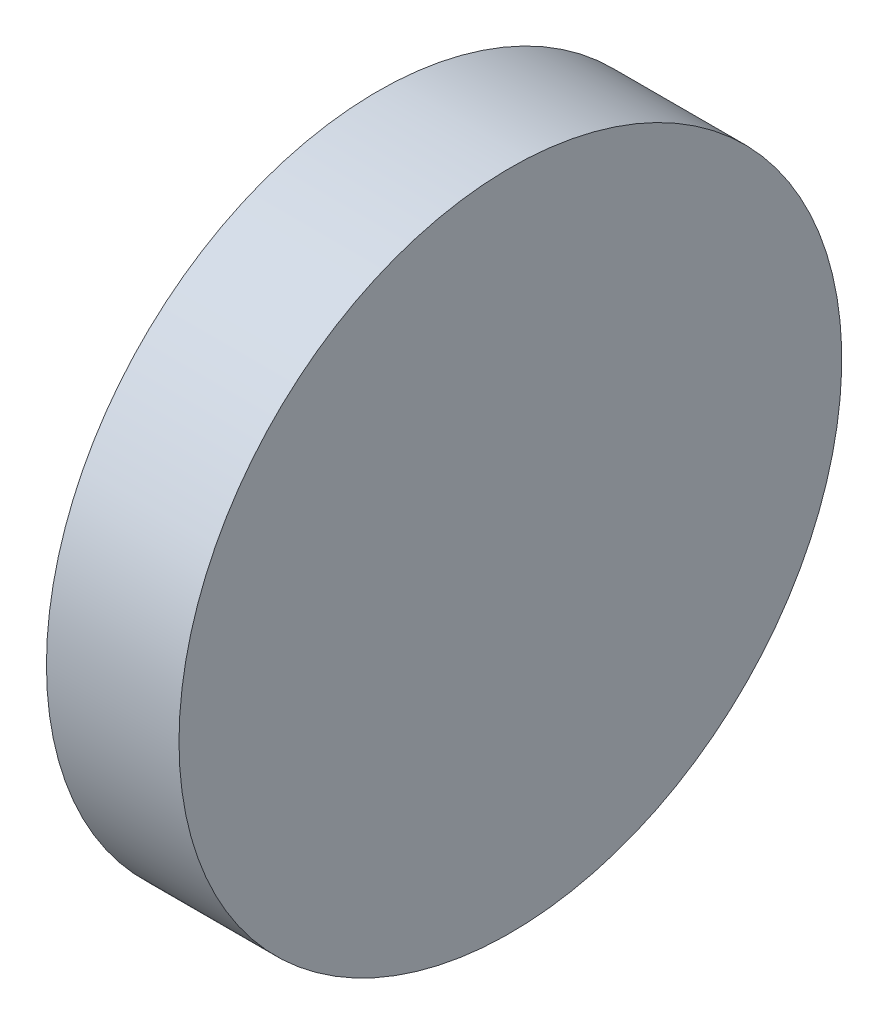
from build123d import *

# Parameters (mm, degrees)
SKIZZE1_W = 5
SKIZZE1_H = 12.5


with BuildPart() as part:
    # Skizze1 → Rotation1 (revolve)
    with BuildSketch(Plane.XY, mode=Mode.PRIVATE) as rotation1_sk:
        with Locations((2.5, 6.25)):
            Rectangle(SKIZZE1_W, SKIZZE1_H)
    revolve(rotation1_sk.sketch.rotate(Axis((5, 0, 0), (1, 0, 0)), 90), axis=Axis((5, 0, 0), (1, 0, 0)))


solid = part.part
